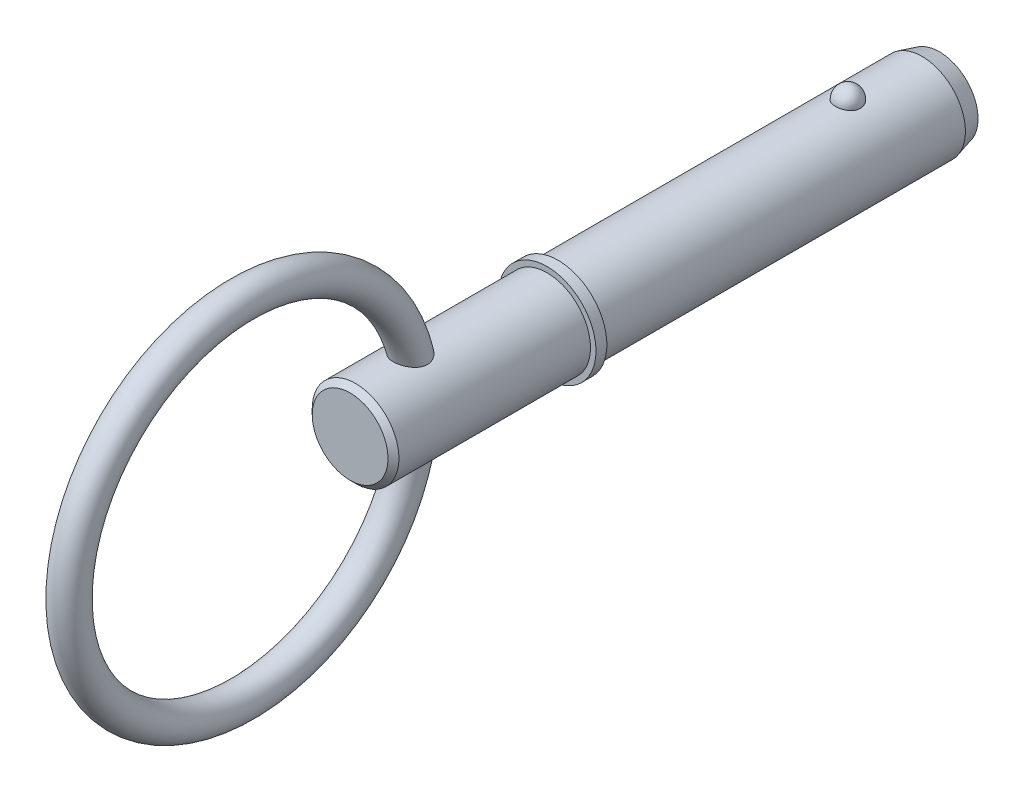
ISO-10303-21;
HEADER;
FILE_DESCRIPTION(('STEP AP214'),'2;1');
FILE_NAME('part.step','',(''),(''),'','','');
FILE_SCHEMA(('AUTOMOTIVE_DESIGN { 1 0 10303 214 1 1 1 1 }'));
ENDSEC;
DATA;
#1=APPLICATION_CONTEXT('core data for automotive mechanical design processes');
#2=APPLICATION_PROTOCOL_DEFINITION('international standard','automotive_design',2000,#1);
#3=PRODUCT_CONTEXT('',#1,'mechanical');
#4=PRODUCT('Part','Part','',(#3));
#5=PRODUCT_RELATED_PRODUCT_CATEGORY('part','',(#4));
#6=PRODUCT_DEFINITION_FORMATION('','',#4);
#7=PRODUCT_DEFINITION_CONTEXT('part definition',#1,'design');
#8=PRODUCT_DEFINITION('design','',#6,#7);
#9=PRODUCT_DEFINITION_SHAPE('','',#8);
#10=(LENGTH_UNIT() NAMED_UNIT(*) SI_UNIT(.MILLI.,.METRE.));
#11=(NAMED_UNIT(*) PLANE_ANGLE_UNIT() SI_UNIT($,.RADIAN.));
#12=(NAMED_UNIT(*) SI_UNIT($,.STERADIAN.) SOLID_ANGLE_UNIT());
#13=UNCERTAINTY_MEASURE_WITH_UNIT(LENGTH_MEASURE(1.E-05),#10,'distance_accuracy_value','');
#14=(GEOMETRIC_REPRESENTATION_CONTEXT(3) GLOBAL_UNCERTAINTY_ASSIGNED_CONTEXT((#13)) GLOBAL_UNIT_ASSIGNED_CONTEXT((#10,
#11,#12)) REPRESENTATION_CONTEXT('',''));
#15=CARTESIAN_POINT('',(0.,0.,0.));
#16=DIRECTION('',(0.,0.,1.));
#17=DIRECTION('',(1.,0.,0.));
#18=AXIS2_PLACEMENT_3D('',#15,#16,#17);
#19=CARTESIAN_POINT('',(0.,0.,25.4));
#20=DIRECTION('',(0.,0.,-1.));
#21=DIRECTION('',(-1.,0.,0.));
#22=AXIS2_PLACEMENT_3D('',#19,#20,#21);
#23=CYLINDRICAL_SURFACE('',#22,3.97);
#24=CARTESIAN_POINT('',(1.13787398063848,3.80343828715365,-1.15));
#25=CARTESIAN_POINT('',(1.13787307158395,3.80343910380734,-1.0857397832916));
#26=CARTESIAN_POINT('',(1.13264657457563,3.80501406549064,-1.02146820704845));
#27=CARTESIAN_POINT('',(1.11186534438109,3.81113760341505,-0.894749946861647));
#28=CARTESIAN_POINT('',(1.09630734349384,3.81568712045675,-0.832303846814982));
#29=CARTESIAN_POINT('',(1.05525533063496,3.82724281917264,-0.711040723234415));
#30=CARTESIAN_POINT('',(1.02976565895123,3.83424792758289,-0.652222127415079));
#31=CARTESIAN_POINT('',(0.969477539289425,3.84993235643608,-0.53981446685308));
#32=CARTESIAN_POINT('',(0.934679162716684,3.85861166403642,-0.486225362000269));
#33=CARTESIAN_POINT('',(0.856427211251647,3.87673176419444,-0.385470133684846));
#34=CARTESIAN_POINT('',(0.812928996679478,3.88617632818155,-0.338339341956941));
#35=CARTESIAN_POINT('',(0.718506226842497,3.90473543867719,-0.252134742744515));
#36=CARTESIAN_POINT('',(0.667581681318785,3.91384998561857,-0.213060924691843));
#37=CARTESIAN_POINT('',(0.559829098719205,3.93070626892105,-0.144169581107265));
#38=CARTESIAN_POINT('',(0.503019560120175,3.93845211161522,-0.114324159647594));
#39=CARTESIAN_POINT('',(0.384957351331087,3.95173781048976,-0.0645874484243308));
#40=CARTESIAN_POINT('',(0.323705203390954,3.95727792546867,-0.0446949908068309));
#41=CARTESIAN_POINT('',(0.1997490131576,3.96544869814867,-0.0157294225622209));
#42=CARTESIAN_POINT('',(0.137095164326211,3.96813298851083,-0.00645660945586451));
#43=CARTESIAN_POINT('',(0.0110617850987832,3.97048461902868,0.00167939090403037));
#44=CARTESIAN_POINT('',(-0.0523176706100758,3.97015226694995,0.000543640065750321));
#45=CARTESIAN_POINT('',(-0.176983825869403,3.96653606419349,-0.0120046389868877));
#46=CARTESIAN_POINT('',(-0.238287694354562,3.96329719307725,-0.0232605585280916));
#47=CARTESIAN_POINT('',(-0.358077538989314,3.95427494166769,-0.0555133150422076));
#48=CARTESIAN_POINT('',(-0.41656346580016,3.94849151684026,-0.0765103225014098));
#49=CARTESIAN_POINT('',(-0.529474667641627,3.9349475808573,-0.127824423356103));
#50=CARTESIAN_POINT('',(-0.583873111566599,3.92717527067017,-0.158197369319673));
#51=CARTESIAN_POINT('',(-0.686796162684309,3.9104901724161,-0.227402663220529));
#52=CARTESIAN_POINT('',(-0.735320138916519,3.90157726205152,-0.266235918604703));
#53=CARTESIAN_POINT('',(-0.826197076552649,3.88336108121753,-0.352210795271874));
#54=CARTESIAN_POINT('',(-0.868404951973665,3.87405356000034,-0.399504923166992));
#55=CARTESIAN_POINT('',(-0.944393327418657,3.85623507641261,-0.500572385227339));
#56=CARTESIAN_POINT('',(-0.978173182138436,3.84772417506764,-0.554346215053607));
#57=CARTESIAN_POINT('',(-1.036841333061,3.83233550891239,-0.667624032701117));
#58=CARTESIAN_POINT('',(-1.06161430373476,3.82547928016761,-0.727190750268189));
#59=CARTESIAN_POINT('',(-1.1010562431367,3.81431496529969,-0.849806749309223));
#60=CARTESIAN_POINT('',(-1.11572551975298,3.81000680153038,-0.912855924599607));
#61=CARTESIAN_POINT('',(-1.13455293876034,3.80444307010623,-1.04035299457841));
#62=CARTESIAN_POINT('',(-1.13875701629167,3.80317416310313,-1.10479351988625));
#63=CARTESIAN_POINT('',(-1.13668244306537,3.80379469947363,-1.23348881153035));
#64=CARTESIAN_POINT('',(-1.13040410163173,3.80568404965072,-1.29774358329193));
#65=CARTESIAN_POINT('',(-1.10758455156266,3.81238701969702,-1.42388263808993));
#66=CARTESIAN_POINT('',(-1.09109911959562,3.81718474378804,-1.48577787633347));
#67=CARTESIAN_POINT('',(-1.04831897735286,3.82915360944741,-1.6058363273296));
#68=CARTESIAN_POINT('',(-1.02202385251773,3.83632485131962,-1.66399938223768));
#69=CARTESIAN_POINT('',(-0.960087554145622,3.85229234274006,-1.77531672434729));
#70=CARTESIAN_POINT('',(-0.924393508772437,3.86109769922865,-1.82844028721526));
#71=CARTESIAN_POINT('',(-0.844617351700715,3.87932868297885,-1.92784641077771));
#72=CARTESIAN_POINT('',(-0.800534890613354,3.88875433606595,-1.97412868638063));
#73=CARTESIAN_POINT('',(-0.704909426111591,3.90722138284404,-2.05875748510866));
#74=CARTESIAN_POINT('',(-0.653336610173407,3.91626104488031,-2.09707073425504));
#75=CARTESIAN_POINT('',(-0.544251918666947,3.93290335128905,-2.16444159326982));
#76=CARTESIAN_POINT('',(-0.486740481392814,3.94050610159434,-2.19349988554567));
#77=CARTESIAN_POINT('',(-0.368186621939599,3.95333328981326,-2.24120607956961));
#78=CARTESIAN_POINT('',(-0.307200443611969,3.9585876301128,-2.25998559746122));
#79=CARTESIAN_POINT('',(-0.182787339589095,3.96627905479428,-2.28716436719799));
#80=CARTESIAN_POINT('',(-0.119360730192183,3.96871650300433,-2.29556495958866));
#81=CARTESIAN_POINT('',(0.00676344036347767,3.97048518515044,-2.30167748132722));
#82=CARTESIAN_POINT('',(0.0694499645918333,3.96987797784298,-2.299601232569));
#83=CARTESIAN_POINT('',(0.193555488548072,3.96576491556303,-2.28530777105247));
#84=CARTESIAN_POINT('',(0.254974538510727,3.96225917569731,-2.27309096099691));
#85=CARTESIAN_POINT('',(0.374550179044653,3.95274547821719,-2.2389384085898));
#86=CARTESIAN_POINT('',(0.432719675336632,3.94674835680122,-2.2170447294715));
#87=CARTESIAN_POINT('',(0.544514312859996,3.93288448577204,-2.16414952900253));
#88=CARTESIAN_POINT('',(0.598139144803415,3.92501760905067,-2.13314738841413));
#89=CARTESIAN_POINT('',(0.700284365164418,3.90809781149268,-2.06228741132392));
#90=CARTESIAN_POINT('',(0.748708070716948,3.89902775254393,-2.02229434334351));
#91=CARTESIAN_POINT('',(0.838215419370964,3.88077133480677,-1.93481443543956));
#92=CARTESIAN_POINT('',(0.879297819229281,3.87158495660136,-1.88732632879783));
#93=CARTESIAN_POINT('',(0.953804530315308,3.85391414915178,-1.78516284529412));
#94=CARTESIAN_POINT('',(0.987071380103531,3.8454460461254,-1.73036973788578));
#95=CARTESIAN_POINT('',(1.04410491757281,3.83035507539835,-1.61582422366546));
#96=CARTESIAN_POINT('',(1.06787445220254,3.82373165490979,-1.5560733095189));
#97=CARTESIAN_POINT('',(1.10358064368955,3.813570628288,-1.43904746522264));
#98=CARTESIAN_POINT('',(1.11641754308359,3.80980198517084,-1.38206535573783));
#99=CARTESIAN_POINT('',(1.13356451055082,3.80473547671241,-1.26672526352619));
#100=CARTESIAN_POINT('',(1.13787480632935,3.80343754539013,-1.20836731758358));
#101=CARTESIAN_POINT('',(1.13787398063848,3.80343828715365,-1.15));
#102=B_SPLINE_CURVE_WITH_KNOTS('',3,(#24,#25,#26,#27,#28,#29,#30,#31,#32,#33,#34,#35,#36,#37,
#38,#39,#40,#41,#42,#43,#44,#45,#46,#47,#48,#49,#50,#51,#52,#53,#54,#55,#56,#57,#58,#59,#60,#61,
#62,#63,#64,#65,#66,#67,#68,#69,#70,#71,#72,#73,#74,#75,#76,#77,#78,#79,#80,#81,#82,#83,#84,#85,
#86,#87,#88,#89,#90,#91,#92,#93,#94,#95,#96,#97,#98,#99,#100,#101),.UNSPECIFIED.,.T.,.F.,(4,2,2,
2,2,2,2,2,2,2,2,2,2,2,2,2,2,2,2,2,2,2,2,2,2,2,2,2,2,2,2,2,2,2,2,2,2,2,4),(0.,0.192571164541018,
0.385203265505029,0.577751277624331,0.770297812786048,0.963858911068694,1.15741975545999,
1.35038964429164,1.54333688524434,1.73259288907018,1.92182958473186,2.10818732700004,
2.2945483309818,2.48204164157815,2.66955507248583,2.86087083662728,3.05220124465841,
3.24590171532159,3.43959628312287,3.63243915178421,3.82527632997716,4.01706893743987,
4.20886965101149,4.40177324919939,4.59468488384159,4.78838651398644,4.9820738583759,
5.17321934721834,5.36434014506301,5.55161251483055,5.7388774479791,5.92533626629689,
6.11180776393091,6.30129785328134,6.49082000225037,6.68388392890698,6.87688993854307,
7.05180628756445,7.22671796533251),.UNSPECIFIED.);
#103=CARTESIAN_POINT('',(1.13787398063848,3.80343828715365,-1.15));
#104=VERTEX_POINT('',#103);
#105=EDGE_CURVE('E103',#104,#104,#102,.T.);
#106=ORIENTED_EDGE('',*,*,#105,.T.);
#107=EDGE_LOOP('',(#106));
#108=FACE_BOUND('',#107,.T.);
#109=CARTESIAN_POINT('',(0.,0.,-7.94399999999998));
#110=DIRECTION('',(0.,0.,-1.));
#111=DIRECTION('',(-1.,0.,0.));
#112=AXIS2_PLACEMENT_3D('',#109,#110,#111);
#113=CIRCLE('',#112,3.97);
#114=CARTESIAN_POINT('',(-3.97,0.,-7.94399999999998));
#115=VERTEX_POINT('',#114);
#116=EDGE_CURVE('E110',#115,#115,#113,.F.);
#117=ORIENTED_EDGE('',*,*,#116,.T.);
#118=EDGE_LOOP('',(#117));
#119=FACE_BOUND('',#118,.T.);
#120=CARTESIAN_POINT('',(0.,0.,25.4));
#121=DIRECTION('',(0.,0.,1.));
#122=DIRECTION('',(1.,0.,0.));
#123=AXIS2_PLACEMENT_3D('',#120,#121,#122);
#124=CIRCLE('',#123,3.97);
#125=CARTESIAN_POINT('',(3.97,0.,25.4));
#126=VERTEX_POINT('',#125);
#127=EDGE_CURVE('E108',#126,#126,#124,.T.);
#128=ORIENTED_EDGE('',*,*,#127,.F.);
#129=EDGE_LOOP('',(#128));
#130=FACE_BOUND('',#129,.T.);
#131=ADVANCED_FACE('F39',(#108,#119,#130),#23,.T.);
#132=CARTESIAN_POINT('',(0.,0.,-9.53));
#133=DIRECTION('',(0.,0.,-1.));
#134=DIRECTION('',(-1.,0.,0.));
#135=AXIS2_PLACEMENT_3D('',#132,#133,#134);
#136=PLANE('',#135);
#137=CARTESIAN_POINT('',(0.,0.,-9.53));
#138=DIRECTION('',(0.,0.,-1.));
#139=DIRECTION('',(-1.,0.,0.));
#140=AXIS2_PLACEMENT_3D('',#137,#138,#139);
#141=CIRCLE('',#140,3.54503258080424);
#142=CARTESIAN_POINT('',(-3.54503258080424,0.,-9.53));
#143=VERTEX_POINT('',#142);
#144=EDGE_CURVE('E143',#143,#143,#141,.T.);
#145=ORIENTED_EDGE('',*,*,#144,.T.);
#146=EDGE_LOOP('',(#145));
#147=FACE_BOUND('',#146,.T.);
#148=ADVANCED_FACE('F89',(#147),#136,.T.);
#149=CARTESIAN_POINT('',(0.,0.,-9.53));
#150=DIRECTION('',(0.,0.,1.));
#151=DIRECTION('',(1.,0.,0.));
#152=AXIS2_PLACEMENT_3D('',#149,#150,#151);
#153=CONICAL_SURFACE('',#152,3.54503258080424,0.261799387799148);
#154=ORIENTED_EDGE('',*,*,#116,.F.);
#155=EDGE_LOOP('',(#154));
#156=FACE_BOUND('',#155,.T.);
#157=ORIENTED_EDGE('',*,*,#144,.F.);
#158=EDGE_LOOP('',(#157));
#159=FACE_BOUND('',#158,.T.);
#160=ADVANCED_FACE('F95',(#156,#159),#153,.T.);
#161=CARTESIAN_POINT('',(0.,3.97,-1.15));
#162=DIRECTION('',(0.,1.,0.));
#163=DIRECTION('',(0.,0.,-1.));
#164=AXIS2_PLACEMENT_3D('',#161,#162,#163);
#165=SPHERICAL_SURFACE('',#164,1.15);
#166=ORIENTED_EDGE('',*,*,#105,.F.);
#167=EDGE_LOOP('',(#166));
#168=FACE_BOUND('',#167,.T.);
#169=ADVANCED_FACE('F113',(#168),#165,.T.);
#170=CARTESIAN_POINT('',(0.,0.,25.4));
#171=DIRECTION('',(0.,0.,-1.));
#172=DIRECTION('',(-1.,0.,0.));
#173=AXIS2_PLACEMENT_3D('',#170,#171,#172);
#174=PLANE('',#173);
#175=ORIENTED_EDGE('',*,*,#127,.T.);
#176=EDGE_LOOP('',(#175));
#177=FACE_BOUND('',#176,.T.);
#178=CARTESIAN_POINT('',(0.,0.,25.4));
#179=DIRECTION('',(0.,0.,-1.));
#180=DIRECTION('',(-1.,0.,0.));
#181=AXIS2_PLACEMENT_3D('',#178,#179,#180);
#182=CIRCLE('',#181,4.47);
#183=CARTESIAN_POINT('',(-4.47,0.,25.4));
#184=VERTEX_POINT('',#183);
#185=EDGE_CURVE('E109',#184,#184,#182,.T.);
#186=ORIENTED_EDGE('',*,*,#185,.T.);
#187=EDGE_LOOP('',(#186));
#188=FACE_BOUND('',#187,.T.);
#189=ADVANCED_FACE('F117',(#177,#188),#174,.T.);
#190=CARTESIAN_POINT('',(0.,0.,33.7287874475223));
#191=DIRECTION('',(0.,0.,-1.));
#192=DIRECTION('',(-1.,0.,0.));
#193=AXIS2_PLACEMENT_3D('',#190,#191,#192);
#194=CYLINDRICAL_SURFACE('',#193,4.47);
#195=CARTESIAN_POINT('',(0.,0.,26.4));
#196=DIRECTION('',(0.,0.,-1.));
#197=DIRECTION('',(-1.,0.,0.));
#198=AXIS2_PLACEMENT_3D('',#195,#196,#197);
#199=CIRCLE('',#198,4.47);
#200=CARTESIAN_POINT('',(-4.47,0.,26.4));
#201=VERTEX_POINT('',#200);
#202=EDGE_CURVE('E134',#201,#201,#199,.T.);
#203=ORIENTED_EDGE('',*,*,#202,.T.);
#204=EDGE_LOOP('',(#203));
#205=FACE_BOUND('',#204,.T.);
#206=ORIENTED_EDGE('',*,*,#185,.F.);
#207=EDGE_LOOP('',(#206));
#208=FACE_BOUND('',#207,.T.);
#209=ADVANCED_FACE('F121',(#205,#208),#194,.T.);
#210=CARTESIAN_POINT('',(0.,4.47,26.4));
#211=DIRECTION('',(0.,0.,1.));
#212=DIRECTION('',(1.,0.,0.));
#213=AXIS2_PLACEMENT_3D('',#210,#211,#212);
#214=PLANE('',#213);
#215=CARTESIAN_POINT('',(0.,0.,26.4));
#216=DIRECTION('',(0.,0.,1.));
#217=DIRECTION('',(1.,0.,0.));
#218=AXIS2_PLACEMENT_3D('',#215,#216,#217);
#219=CIRCLE('',#218,3.97);
#220=CARTESIAN_POINT('',(3.97,0.,26.4));
#221=VERTEX_POINT('',#220);
#222=EDGE_CURVE('E112',#221,#221,#219,.T.);
#223=ORIENTED_EDGE('',*,*,#222,.F.);
#224=EDGE_LOOP('',(#223));
#225=FACE_BOUND('',#224,.T.);
#226=ORIENTED_EDGE('',*,*,#202,.F.);
#227=EDGE_LOOP('',(#226));
#228=FACE_BOUND('',#227,.T.);
#229=ADVANCED_FACE('F86',(#225,#228),#214,.T.);
#230=CARTESIAN_POINT('',(0.,0.,44.45));
#231=DIRECTION('',(0.,0.,-1.));
#232=DIRECTION('',(-1.,0.,0.));
#233=AXIS2_PLACEMENT_3D('',#230,#231,#232);
#234=CYLINDRICAL_SURFACE('',#233,3.97);
#235=CARTESIAN_POINT('',(-0.740636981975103,-3.90030215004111,37.5942081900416));
#236=CARTESIAN_POINT('',(-0.667733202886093,-3.91414543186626,37.554930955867));
#237=CARTESIAN_POINT('',(-0.591347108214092,-3.92651643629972,37.5215983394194));
#238=CARTESIAN_POINT('',(-0.433709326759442,-3.94703799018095,37.4675410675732));
#239=CARTESIAN_POINT('',(-0.352458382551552,-3.95518918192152,37.4468144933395));
#240=CARTESIAN_POINT('',(-0.187320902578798,-3.96644185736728,37.4184263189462));
#241=CARTESIAN_POINT('',(-0.10343312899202,-3.9695409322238,37.4107709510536));
#242=CARTESIAN_POINT('',(0.0645297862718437,-3.97036376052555,37.4087268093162));
#243=CARTESIAN_POINT('',(0.148604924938,-3.96808759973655,37.4143378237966));
#244=CARTESIAN_POINT('',(0.313967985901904,-3.95842655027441,37.4386101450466));
#245=CARTESIAN_POINT('',(0.395270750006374,-3.95107581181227,37.4571842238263));
#246=CARTESIAN_POINT('',(0.553418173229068,-3.93204472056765,37.5068699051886));
#247=CARTESIAN_POINT('',(0.630262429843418,-3.92036397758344,37.5379826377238));
#248=CARTESIAN_POINT('',(0.77798376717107,-3.89375421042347,37.6123739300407));
#249=CARTESIAN_POINT('',(0.84880915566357,-3.8788003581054,37.6557462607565));
#250=CARTESIAN_POINT('',(0.981880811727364,-3.84727071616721,37.7536515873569));
#251=CARTESIAN_POINT('',(1.04412630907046,-3.83069478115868,37.8081855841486));
#252=CARTESIAN_POINT('',(1.15846819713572,-3.79768496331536,37.9274397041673));
#253=CARTESIAN_POINT('',(1.21053047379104,-3.78125172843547,37.9921927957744));
#254=CARTESIAN_POINT('',(1.30266807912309,-3.75050988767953,38.1301698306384));
#255=CARTESIAN_POINT('',(1.34274789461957,-3.73620048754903,38.2033905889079));
#256=CARTESIAN_POINT('',(1.40857853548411,-3.71187334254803,38.3536278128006));
#257=CARTESIAN_POINT('',(1.43477198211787,-3.70172571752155,38.4304292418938));
#258=CARTESIAN_POINT('',(1.47426417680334,-3.68617713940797,38.5877211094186));
#259=CARTESIAN_POINT('',(1.48756557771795,-3.68077520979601,38.668210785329));
#260=CARTESIAN_POINT('',(1.5011302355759,-3.67526295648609,38.8282774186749));
#261=CARTESIAN_POINT('',(1.50172918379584,-3.67501639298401,38.9078221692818));
#262=CARTESIAN_POINT('',(1.4912869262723,-3.67926498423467,39.0660010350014));
#263=CARTESIAN_POINT('',(1.48024221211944,-3.68376156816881,39.1446348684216));
#264=CARTESIAN_POINT('',(1.44631002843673,-3.69722026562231,39.3039961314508));
#265=CARTESIAN_POINT('',(1.42273446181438,-3.7064405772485,39.3845537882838));
#266=CARTESIAN_POINT('',(1.36440745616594,-3.72830487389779,39.5410229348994));
#267=CARTESIAN_POINT('',(1.32965006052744,-3.74095068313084,39.6169319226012));
#268=CARTESIAN_POINT('',(1.244983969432,-3.77003365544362,39.7715893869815));
#269=CARTESIAN_POINT('',(1.19374759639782,-3.78674477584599,39.8495625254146));
#270=CARTESIAN_POINT('',(1.07927226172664,-3.82094743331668,39.996060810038));
#271=CARTESIAN_POINT('',(1.01602347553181,-3.83843960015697,40.0645781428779));
#272=CARTESIAN_POINT('',(0.875824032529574,-3.87288453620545,40.1922425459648));
#273=CARTESIAN_POINT('',(0.798445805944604,-3.88979192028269,40.2509375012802));
#274=CARTESIAN_POINT('',(0.633271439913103,-3.92005992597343,40.3524486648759));
#275=CARTESIAN_POINT('',(0.545492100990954,-3.9334261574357,40.3952900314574));
#276=CARTESIAN_POINT('',(0.374503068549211,-3.9531041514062,40.4573026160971));
#277=CARTESIAN_POINT('',(0.292250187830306,-3.96011991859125,40.4788718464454));
#278=CARTESIAN_POINT('',(0.124887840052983,-3.96891507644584,40.5058171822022));
#279=CARTESIAN_POINT('',(0.0397822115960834,-3.97070123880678,40.511214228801));
#280=CARTESIAN_POINT('',(-0.116598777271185,-3.96893737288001,40.5058414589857));
#281=CARTESIAN_POINT('',(-0.187977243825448,-3.96616998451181,40.4974431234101));
#282=CARTESIAN_POINT('',(-0.32822445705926,-3.95703238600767,40.4693459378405));
#283=CARTESIAN_POINT('',(-0.397092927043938,-3.95066177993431,40.4496458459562));
#284=CARTESIAN_POINT('',(-0.530777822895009,-3.93493622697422,40.400002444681));
#285=CARTESIAN_POINT('',(-0.595585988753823,-3.92557541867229,40.3700390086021));
#286=CARTESIAN_POINT('',(-0.719890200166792,-3.904694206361,40.3012213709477));
#287=CARTESIAN_POINT('',(-0.779384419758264,-3.89317306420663,40.2623641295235));
#288=CARTESIAN_POINT('',(-0.900171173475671,-3.86715924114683,40.1711356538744));
#289=CARTESIAN_POINT('',(-0.960570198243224,-3.85247602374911,40.1176378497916));
#290=CARTESIAN_POINT('',(-1.07286582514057,-3.82272677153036,40.0024377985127));
#291=CARTESIAN_POINT('',(-1.12475588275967,-3.8076604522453,39.9407293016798));
#292=CARTESIAN_POINT('',(-1.22682603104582,-3.77611978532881,39.8003072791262));
#293=CARTESIAN_POINT('',(-1.27547686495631,-3.75979238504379,39.7204426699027));
#294=CARTESIAN_POINT('',(-1.35956460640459,-3.73021138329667,39.5534537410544));
#295=CARTESIAN_POINT('',(-1.39499536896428,-3.71695921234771,39.4663260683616));
#296=CARTESIAN_POINT('',(-1.45224550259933,-3.6949785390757,39.2837644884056));
#297=CARTESIAN_POINT('',(-1.47355906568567,-3.68641985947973,39.1881485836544));
#298=CARTESIAN_POINT('',(-1.49891316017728,-3.67618897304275,38.9943060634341));
#299=CARTESIAN_POINT('',(-1.50297414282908,-3.67450861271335,38.8960826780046));
#300=CARTESIAN_POINT('',(-1.49322338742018,-3.67847743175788,38.7115204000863));
#301=CARTESIAN_POINT('',(-1.48132891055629,-3.68334053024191,38.625062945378));
#302=CARTESIAN_POINT('',(-1.44277978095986,-3.69860964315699,38.4560202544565));
#303=CARTESIAN_POINT('',(-1.4161310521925,-3.70901343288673,38.3734334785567));
#304=CARTESIAN_POINT('',(-1.35164005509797,-3.73296583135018,38.2217432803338));
#305=CARTESIAN_POINT('',(-1.31494998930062,-3.74616939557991,38.1520907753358));
#306=CARTESIAN_POINT('',(-1.23078033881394,-3.77465882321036,38.0201142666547));
#307=CARTESIAN_POINT('',(-1.18329862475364,-3.7899450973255,37.9577917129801));
#308=CARTESIAN_POINT('',(-1.07555346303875,-3.82196646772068,37.838244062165));
#309=CARTESIAN_POINT('',(-1.01467770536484,-3.83873247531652,37.7815789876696));
#310=CARTESIAN_POINT('',(-0.883925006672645,-3.87093079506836,37.679334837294));
#311=CARTESIAN_POINT('',(-0.814046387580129,-3.88636285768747,37.6337578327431));
#312=CARTESIAN_POINT('',(-0.740636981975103,-3.90030215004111,37.5942081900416));
#313=B_SPLINE_CURVE_WITH_KNOTS('',3,(#235,#236,#237,#238,#239,#240,#241,#242,#243,#244,#245,
#246,#247,#248,#249,#250,#251,#252,#253,#254,#255,#256,#257,#258,#259,#260,#261,#262,#263,#264,
#265,#266,#267,#268,#269,#270,#271,#272,#273,#274,#275,#276,#277,#278,#279,#280,#281,#282,#283,
#284,#285,#286,#287,#288,#289,#290,#291,#292,#293,#294,#295,#296,#297,#298,#299,#300,#301,#302,
#303,#304,#305,#306,#307,#308,#309,#310,#311,#312),.UNSPECIFIED.,.T.,.F.,(4,2,2,2,2,2,2,2,2,2,2,
2,2,2,2,2,2,2,2,2,2,2,2,2,2,2,2,2,2,2,2,2,2,2,2,2,2,2,4),(0.,0.251585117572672,
0.503131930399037,0.754798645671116,1.00646134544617,1.25644674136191,1.50645467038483,
1.75842915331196,2.01042624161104,2.26325358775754,2.5159861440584,2.76008726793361,
3.00413815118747,3.24173115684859,3.47939577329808,3.73171171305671,3.9841622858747,
4.26728153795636,4.55063334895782,4.84469622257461,5.13829042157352,5.39265192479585,
5.64668391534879,5.86142364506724,6.07618697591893,6.29137389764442,6.50663447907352,
6.75172833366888,6.99700982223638,7.28055118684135,7.56422418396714,7.85757857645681,
8.15058512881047,8.41135406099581,8.67201836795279,8.91039015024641,9.14880900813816,
9.40209172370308,9.65542171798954),.UNSPECIFIED.);
#314=CARTESIAN_POINT('',(-0.740636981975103,-3.90030215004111,37.5942081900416));
#315=VERTEX_POINT('',#314);
#316=EDGE_CURVE('E10',#315,#315,#313,.T.);
#317=ORIENTED_EDGE('',*,*,#316,.F.);
#318=EDGE_LOOP('',(#317));
#319=FACE_BOUND('',#318,.T.);
#320=CARTESIAN_POINT('',(-0.740636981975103,3.90030215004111,37.5942081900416));
#321=CARTESIAN_POINT('',(-0.813118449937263,3.88653971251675,37.6332571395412));
#322=CARTESIAN_POINT('',(-0.882149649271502,3.8713229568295,37.6781781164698));
#323=CARTESIAN_POINT('',(-1.01146335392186,3.83956738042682,37.7788428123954));
#324=CARTESIAN_POINT('',(-1.07174704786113,3.82302873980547,37.8345850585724));
#325=CARTESIAN_POINT('',(-1.18196955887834,3.79040422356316,37.9557938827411));
#326=CARTESIAN_POINT('',(-1.23189269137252,3.77431906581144,38.021274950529));
#327=CARTESIAN_POINT('',(-1.31978443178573,3.74449359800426,38.1602948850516));
#328=CARTESIAN_POINT('',(-1.35775694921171,3.73075252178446,38.2338311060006));
#329=CARTESIAN_POINT('',(-1.41974909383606,3.7075981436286,38.3847128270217));
#330=CARTESIAN_POINT('',(-1.44413408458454,3.69807309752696,38.4618910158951));
#331=CARTESIAN_POINT('',(-1.4800654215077,3.6838411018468,38.619590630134));
#332=CARTESIAN_POINT('',(-1.49161368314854,3.67913343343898,38.7001115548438));
#333=CARTESIAN_POINT('',(-1.50187378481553,3.67495610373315,38.8602618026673));
#334=CARTESIAN_POINT('',(-1.50086613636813,3.67537197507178,38.9398709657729));
#335=CARTESIAN_POINT('',(-1.48728932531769,3.68088569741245,39.0979172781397));
#336=CARTESIAN_POINT('',(-1.47471654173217,3.68598501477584,39.1763540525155));
#337=CARTESIAN_POINT('',(-1.43761932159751,3.70061780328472,39.3355940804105));
#338=CARTESIAN_POINT('',(-1.41233843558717,3.71042990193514,39.4161940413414));
#339=CARTESIAN_POINT('',(-1.35057314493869,3.73335405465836,39.5724850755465));
#340=CARTESIAN_POINT('',(-1.31408239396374,3.74646797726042,39.6481733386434));
#341=CARTESIAN_POINT('',(-1.2257172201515,3.77636700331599,39.8020428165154));
#342=CARTESIAN_POINT('',(-1.17251505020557,3.79340436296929,39.8794161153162));
#343=CARTESIAN_POINT('',(-1.05406412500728,3.82800923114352,40.0243069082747));
#344=CARTESIAN_POINT('',(-0.988806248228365,3.84557713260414,40.0918168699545));
#345=CARTESIAN_POINT('',(-0.845287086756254,3.87968695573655,40.2162211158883));
#346=CARTESIAN_POINT('',(-0.766724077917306,3.89618874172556,40.2727822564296));
#347=CARTESIAN_POINT('',(-0.599538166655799,3.92537936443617,40.3696962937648));
#348=CARTESIAN_POINT('',(-0.510933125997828,3.93807482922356,40.4100774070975));
#349=CARTESIAN_POINT('',(-0.339677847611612,3.95624165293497,40.4670085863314));
#350=CARTESIAN_POINT('',(-0.25796808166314,3.96248273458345,40.4861280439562));
#351=CARTESIAN_POINT('',(-0.0922002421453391,3.96979198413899,40.5084736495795));
#352=CARTESIAN_POINT('',(-0.0081449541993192,3.97086604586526,40.5117179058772));
#353=CARTESIAN_POINT('',(0.146484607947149,3.96793776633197,40.5027977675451));
#354=CARTESIAN_POINT('',(0.217212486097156,3.96466338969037,40.4928433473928));
#355=CARTESIAN_POINT('',(0.355938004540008,3.95462310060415,40.4618888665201));
#356=CARTESIAN_POINT('',(0.423935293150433,3.94785673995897,40.440887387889));
#357=CARTESIAN_POINT('',(0.556534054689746,3.93137424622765,40.3886148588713));
#358=CARTESIAN_POINT('',(0.621075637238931,3.92161865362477,40.3572059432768));
#359=CARTESIAN_POINT('',(0.744663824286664,3.90004074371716,40.2855756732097));
#360=CARTESIAN_POINT('',(0.803708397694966,3.88821766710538,40.2453510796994));
#361=CARTESIAN_POINT('',(0.923664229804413,3.86161149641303,40.1510569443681));
#362=CARTESIAN_POINT('',(0.983622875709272,3.84664723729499,40.0958282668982));
#363=CARTESIAN_POINT('',(1.09477654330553,3.81650197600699,39.9771942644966));
#364=CARTESIAN_POINT('',(1.14596459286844,3.80132081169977,39.9137825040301));
#365=CARTESIAN_POINT('',(1.24603510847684,3.76980809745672,39.7699890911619));
#366=CARTESIAN_POINT('',(1.29338223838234,3.753652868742,39.6884933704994));
#367=CARTESIAN_POINT('',(1.37450267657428,3.72471527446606,39.5183960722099));
#368=CARTESIAN_POINT('',(1.40827109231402,3.71193412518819,39.4297919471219));
#369=CARTESIAN_POINT('',(1.46140533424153,3.69134610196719,39.2455436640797));
#370=CARTESIAN_POINT('',(1.48042991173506,3.6836576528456,39.1497859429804));
#371=CARTESIAN_POINT('',(1.50115029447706,3.67526750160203,38.9561286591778));
#372=CARTESIAN_POINT('',(1.50286713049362,3.67455732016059,38.8582318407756));
#373=CARTESIAN_POINT('',(1.48878143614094,3.68028077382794,38.6752085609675));
#374=CARTESIAN_POINT('',(1.47496153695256,3.68590609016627,38.5899028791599));
#375=CARTESIAN_POINT('',(1.43287242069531,3.70247002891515,38.4234763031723));
#376=CARTESIAN_POINT('',(1.40460762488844,3.7134070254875,38.3423541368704));
#377=CARTESIAN_POINT('',(1.33714680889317,3.7381964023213,38.1931046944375));
#378=CARTESIAN_POINT('',(1.2989833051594,3.75175245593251,38.1244572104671));
#379=CARTESIAN_POINT('',(1.21206000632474,3.78072797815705,37.9946829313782));
#380=CARTESIAN_POINT('',(1.16329942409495,3.79614758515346,37.9335566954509));
#381=CARTESIAN_POINT('',(1.05526740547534,3.82760231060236,37.8188656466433));
#382=CARTESIAN_POINT('',(0.9957829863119,3.84364346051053,37.7655033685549));
#383=CARTESIAN_POINT('',(0.868651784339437,3.8743538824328,37.6690998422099));
#384=CARTESIAN_POINT('',(0.801003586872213,3.88902291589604,37.6260603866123));
#385=CARTESIAN_POINT('',(0.656696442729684,3.91602140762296,37.5497891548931));
#386=CARTESIAN_POINT('',(0.579799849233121,3.92824686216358,37.5169691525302));
#387=CARTESIAN_POINT('',(0.421219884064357,3.94839960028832,37.4640374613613));
#388=CARTESIAN_POINT('',(0.33953671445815,3.95632706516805,37.4439252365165));
#389=CARTESIAN_POINT('',(0.173681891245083,3.96706909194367,37.4168661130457));
#390=CARTESIAN_POINT('',(0.089510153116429,3.96988347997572,37.4099196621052));
#391=CARTESIAN_POINT('',(-0.078891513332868,3.97010941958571,37.4093589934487));
#392=CARTESIAN_POINT('',(-0.16312144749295,3.96752031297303,37.4157463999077));
#393=CARTESIAN_POINT('',(-0.33291130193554,3.9569711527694,37.4422872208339));
#394=CARTESIAN_POINT('',(-0.418363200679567,3.94877687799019,37.4630414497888));
#395=CARTESIAN_POINT('',(-0.584033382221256,3.92769448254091,37.5184250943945));
#396=CARTESIAN_POINT('',(-0.664251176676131,3.91480592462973,37.5530558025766));
#397=CARTESIAN_POINT('',(-0.740636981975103,3.90030215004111,37.5942081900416));
#398=B_SPLINE_CURVE_WITH_KNOTS('',3,(#320,#321,#322,#323,#324,#325,#326,#327,#328,#329,#330,
#331,#332,#333,#334,#335,#336,#337,#338,#339,#340,#341,#342,#343,#344,#345,#346,#347,#348,#349,
#350,#351,#352,#353,#354,#355,#356,#357,#358,#359,#360,#361,#362,#363,#364,#365,#366,#367,#368,
#369,#370,#371,#372,#373,#374,#375,#376,#377,#378,#379,#380,#381,#382,#383,#384,#385,#386,#387,
#388,#389,#390,#391,#392,#393,#394,#395,#396,#397),.UNSPECIFIED.,.T.,.F.,(4,2,2,2,2,2,2,2,2,2,2,
2,2,2,2,2,2,2,2,2,2,2,2,2,2,2,2,2,2,2,2,2,2,2,2,2,2,2,4),(0.,0.250115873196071,
0.500197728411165,0.750655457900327,1.00103116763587,1.24430196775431,1.48753646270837,
1.72534678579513,1.96323159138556,2.21733609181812,2.47158471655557,2.75662009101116,
3.04187201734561,3.3347718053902,3.62715855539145,3.87803518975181,4.12862559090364,
4.34211896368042,4.55563974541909,4.77211030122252,4.98866052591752,5.23635199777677,
5.48423946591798,5.76983687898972,6.05553710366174,6.3476672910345,6.63944246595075,
6.89782349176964,7.15612548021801,7.39414671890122,7.63218564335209,7.87561406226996,
8.11908472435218,8.37137533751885,8.62365530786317,8.87594385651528,9.12826313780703,
9.39182737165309,9.65541616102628),.UNSPECIFIED.);
#399=CARTESIAN_POINT('',(-0.740636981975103,3.90030215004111,37.5942081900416));
#400=VERTEX_POINT('',#399);
#401=EDGE_CURVE('E51',#400,#400,#398,.T.);
#402=ORIENTED_EDGE('',*,*,#401,.F.);
#403=EDGE_LOOP('',(#402));
#404=FACE_BOUND('',#403,.T.);
#405=CARTESIAN_POINT('',(0.,0.,43.95));
#406=DIRECTION('',(0.,0.,-1.));
#407=DIRECTION('',(-1.,0.,0.));
#408=AXIS2_PLACEMENT_3D('',#405,#406,#407);
#409=CIRCLE('',#408,3.97);
#410=CARTESIAN_POINT('',(-3.97,0.,43.95));
#411=VERTEX_POINT('',#410);
#412=EDGE_CURVE('E65',#411,#411,#409,.T.);
#413=ORIENTED_EDGE('',*,*,#412,.T.);
#414=EDGE_LOOP('',(#413));
#415=FACE_BOUND('',#414,.T.);
#416=ORIENTED_EDGE('',*,*,#222,.T.);
#417=EDGE_LOOP('',(#416));
#418=FACE_BOUND('',#417,.T.);
#419=ADVANCED_FACE('F70',(#319,#404,#415,#418),#234,.T.);
#420=CARTESIAN_POINT('',(0.,0.,44.45));
#421=DIRECTION('',(0.,0.,-1.));
#422=DIRECTION('',(-1.,0.,0.));
#423=AXIS2_PLACEMENT_3D('',#420,#421,#422);
#424=PLANE('',#423);
#425=CARTESIAN_POINT('',(0.,0.,44.45));
#426=DIRECTION('',(0.,0.,-1.));
#427=DIRECTION('',(-1.,0.,0.));
#428=AXIS2_PLACEMENT_3D('',#425,#426,#427);
#429=CIRCLE('',#428,3.46999999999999);
#430=CARTESIAN_POINT('',(-3.46999999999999,0.,44.45));
#431=VERTEX_POINT('',#430);
#432=EDGE_CURVE('E58',#431,#431,#429,.F.);
#433=ORIENTED_EDGE('',*,*,#432,.T.);
#434=EDGE_LOOP('',(#433));
#435=FACE_BOUND('',#434,.T.);
#436=ADVANCED_FACE('F77',(#435),#424,.F.);
#437=CARTESIAN_POINT('',(0.,0.,43.95));
#438=DIRECTION('',(0.,0.,-1.));
#439=DIRECTION('',(-1.,0.,0.));
#440=AXIS2_PLACEMENT_3D('',#437,#438,#439);
#441=CONICAL_SURFACE('',#440,3.97,0.785398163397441);
#442=ORIENTED_EDGE('',*,*,#432,.F.);
#443=EDGE_LOOP('',(#442));
#444=FACE_BOUND('',#443,.T.);
#445=ORIENTED_EDGE('',*,*,#412,.F.);
#446=EDGE_LOOP('',(#445));
#447=FACE_BOUND('',#446,.T.);
#448=ADVANCED_FACE('F41',(#444,#447),#441,.T.);
#449=CARTESIAN_POINT('',(0.,0.,54.325));
#450=DIRECTION('',(1.,0.,0.));
#451=DIRECTION('',(0.,0.,-1.));
#452=AXIS2_PLACEMENT_3D('',#449,#450,#451);
#453=TOROIDAL_SURFACE('',#452,15.875,1.5);
#454=ORIENTED_EDGE('',*,*,#316,.T.);
#455=EDGE_LOOP('',(#454));
#456=FACE_BOUND('',#455,.T.);
#457=ORIENTED_EDGE('',*,*,#401,.T.);
#458=EDGE_LOOP('',(#457));
#459=FACE_BOUND('',#458,.T.);
#460=ADVANCED_FACE('F74',(#456,#459),#453,.T.);
#461=CLOSED_SHELL('',(#131,#148,#160,#169,#189,#209,#229,#419,#436,#448,#460));
#462=MANIFOLD_SOLID_BREP('B2',#461);
#463=ADVANCED_BREP_SHAPE_REPRESENTATION('',(#18,#462),#14);
#464=SHAPE_DEFINITION_REPRESENTATION(#9,#463);
ENDSEC;
END-ISO-10303-21;
